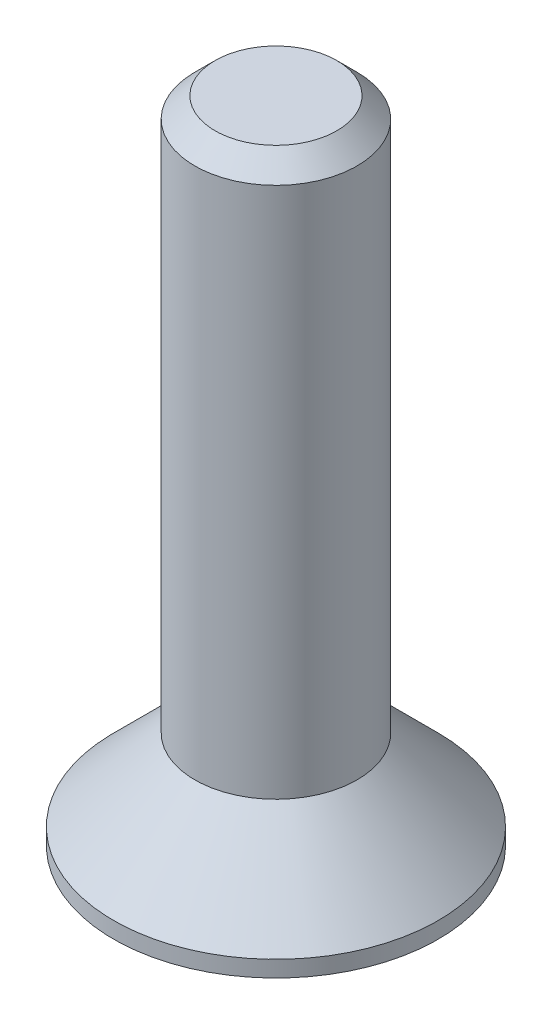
ISO-10303-21;
HEADER;
FILE_DESCRIPTION(('STEP AP214'),'2;1');
FILE_NAME('part.step','',(''),(''),'','','');
FILE_SCHEMA(('AUTOMOTIVE_DESIGN { 1 0 10303 214 1 1 1 1 }'));
ENDSEC;
DATA;
#1=APPLICATION_CONTEXT('core data for automotive mechanical design processes');
#2=APPLICATION_PROTOCOL_DEFINITION('international standard','automotive_design',2000,#1);
#3=PRODUCT_CONTEXT('',#1,'mechanical');
#4=PRODUCT('Part','Part','',(#3));
#5=PRODUCT_RELATED_PRODUCT_CATEGORY('part','',(#4));
#6=PRODUCT_DEFINITION_FORMATION('','',#4);
#7=PRODUCT_DEFINITION_CONTEXT('part definition',#1,'design');
#8=PRODUCT_DEFINITION('design','',#6,#7);
#9=PRODUCT_DEFINITION_SHAPE('','',#8);
#10=(LENGTH_UNIT() NAMED_UNIT(*) SI_UNIT(.MILLI.,.METRE.));
#11=(NAMED_UNIT(*) PLANE_ANGLE_UNIT() SI_UNIT($,.RADIAN.));
#12=(NAMED_UNIT(*) SI_UNIT($,.STERADIAN.) SOLID_ANGLE_UNIT());
#13=UNCERTAINTY_MEASURE_WITH_UNIT(LENGTH_MEASURE(1.E-05),#10,'distance_accuracy_value','');
#14=(GEOMETRIC_REPRESENTATION_CONTEXT(3) GLOBAL_UNCERTAINTY_ASSIGNED_CONTEXT((#13)) GLOBAL_UNIT_ASSIGNED_CONTEXT((#10,
#11,#12)) REPRESENTATION_CONTEXT('',''));
#15=CARTESIAN_POINT('',(0.,0.,0.));
#16=DIRECTION('',(0.,0.,1.));
#17=DIRECTION('',(1.,0.,0.));
#18=AXIS2_PLACEMENT_3D('',#15,#16,#17);
#19=CARTESIAN_POINT('',(-2.,16.,0.));
#20=DIRECTION('',(0.,-1.,0.));
#21=DIRECTION('',(0.,0.,-1.));
#22=AXIS2_PLACEMENT_3D('',#19,#20,#21);
#23=PLANE('',#22);
#24=CARTESIAN_POINT('',(0.,16.,0.));
#25=DIRECTION('',(0.,-1.,0.));
#26=DIRECTION('',(0.,0.,-1.));
#27=AXIS2_PLACEMENT_3D('',#24,#25,#26);
#28=CIRCLE('',#27,1.5);
#29=CARTESIAN_POINT('',(0.,16.,-1.5));
#30=VERTEX_POINT('',#29);
#31=EDGE_CURVE('E11',#30,#30,#28,.F.);
#32=ORIENTED_EDGE('',*,*,#31,.T.);
#33=EDGE_LOOP('',(#32));
#34=FACE_BOUND('',#33,.T.);
#35=ADVANCED_FACE('F32',(#34),#23,.F.);
#36=CARTESIAN_POINT('',(0.,0.,0.));
#37=DIRECTION('',(0.,-1.,0.));
#38=DIRECTION('',(0.,0.,-1.));
#39=AXIS2_PLACEMENT_3D('',#36,#37,#38);
#40=CYLINDRICAL_SURFACE('',#39,2.);
#41=CARTESIAN_POINT('',(0.,15.5,0.));
#42=DIRECTION('',(0.,-1.,0.));
#43=DIRECTION('',(0.,0.,-1.));
#44=AXIS2_PLACEMENT_3D('',#41,#42,#43);
#45=CIRCLE('',#44,2.);
#46=CARTESIAN_POINT('',(0.,15.5,-2.));
#47=VERTEX_POINT('',#46);
#48=EDGE_CURVE('E39',#47,#47,#45,.T.);
#49=ORIENTED_EDGE('',*,*,#48,.T.);
#50=EDGE_LOOP('',(#49));
#51=FACE_BOUND('',#50,.T.);
#52=CARTESIAN_POINT('',(0.,2.4,0.));
#53=DIRECTION('',(0.,-1.,0.));
#54=DIRECTION('',(0.,0.,-1.));
#55=AXIS2_PLACEMENT_3D('',#52,#53,#54);
#56=CIRCLE('',#55,2.);
#57=CARTESIAN_POINT('',(0.,2.4,-2.));
#58=VERTEX_POINT('',#57);
#59=EDGE_CURVE('E146',#58,#58,#56,.T.);
#60=ORIENTED_EDGE('',*,*,#59,.F.);
#61=EDGE_LOOP('',(#60));
#62=FACE_BOUND('',#61,.T.);
#63=ADVANCED_FACE('F151',(#51,#62),#40,.T.);
#64=CARTESIAN_POINT('',(0.,2.4,0.));
#65=DIRECTION('',(0.,-1.,0.));
#66=DIRECTION('',(0.,0.,-1.));
#67=AXIS2_PLACEMENT_3D('',#64,#65,#66);
#68=CONICAL_SURFACE('',#67,2.,0.785398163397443);
#69=CARTESIAN_POINT('',(0.,0.399999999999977,0.));
#70=DIRECTION('',(0.,-1.,0.));
#71=DIRECTION('',(0.,0.,-1.));
#72=AXIS2_PLACEMENT_3D('',#69,#70,#71);
#73=CIRCLE('',#72,4.);
#74=CARTESIAN_POINT('',(0.,0.399999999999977,-4.));
#75=VERTEX_POINT('',#74);
#76=EDGE_CURVE('E143',#75,#75,#73,.T.);
#77=ORIENTED_EDGE('',*,*,#76,.F.);
#78=EDGE_LOOP('',(#77));
#79=FACE_BOUND('',#78,.T.);
#80=ORIENTED_EDGE('',*,*,#59,.T.);
#81=EDGE_LOOP('',(#80));
#82=FACE_BOUND('',#81,.T.);
#83=ADVANCED_FACE('F173',(#79,#82),#68,.T.);
#84=CARTESIAN_POINT('',(0.,0.,0.));
#85=DIRECTION('',(0.,-1.,0.));
#86=DIRECTION('',(0.,0.,-1.));
#87=AXIS2_PLACEMENT_3D('',#84,#85,#86);
#88=CYLINDRICAL_SURFACE('',#87,4.);
#89=CARTESIAN_POINT('',(0.,0.,0.));
#90=DIRECTION('',(0.,-1.,0.));
#91=DIRECTION('',(0.,0.,-1.));
#92=AXIS2_PLACEMENT_3D('',#89,#90,#91);
#93=CIRCLE('',#92,4.);
#94=CARTESIAN_POINT('',(0.,0.,-4.));
#95=VERTEX_POINT('',#94);
#96=EDGE_CURVE('E134',#95,#95,#93,.T.);
#97=ORIENTED_EDGE('',*,*,#96,.F.);
#98=EDGE_LOOP('',(#97));
#99=FACE_BOUND('',#98,.T.);
#100=ORIENTED_EDGE('',*,*,#76,.T.);
#101=EDGE_LOOP('',(#100));
#102=FACE_BOUND('',#101,.T.);
#103=ADVANCED_FACE('F165',(#99,#102),#88,.T.);
#104=CARTESIAN_POINT('',(0.,0.,0.));
#105=DIRECTION('',(0.,1.,0.));
#106=DIRECTION('',(0.,0.,1.));
#107=AXIS2_PLACEMENT_3D('',#104,#105,#106);
#108=PLANE('',#107);
#109=DIRECTION('',(-0.866025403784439,0.,0.5));
#110=VECTOR('',#109,1.);
#111=CARTESIAN_POINT('',(1.25,0.,0.721687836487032));
#112=LINE('',#111,#110);
#113=CARTESIAN_POINT('',(1.25,0.,0.721687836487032));
#114=VERTEX_POINT('',#113);
#115=CARTESIAN_POINT('',(0.,0.,1.44337567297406));
#116=VERTEX_POINT('',#115);
#117=EDGE_CURVE('E100',#114,#116,#112,.T.);
#118=ORIENTED_EDGE('',*,*,#117,.F.);
#119=DIRECTION('',(0.,0.,1.));
#120=VECTOR('',#119,1.);
#121=CARTESIAN_POINT('',(1.25,0.,-0.721687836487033));
#122=LINE('',#121,#120);
#123=CARTESIAN_POINT('',(1.25,0.,-0.721687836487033));
#124=VERTEX_POINT('',#123);
#125=EDGE_CURVE('E46',#124,#114,#122,.T.);
#126=ORIENTED_EDGE('',*,*,#125,.F.);
#127=DIRECTION('',(0.866025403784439,0.,0.5));
#128=VECTOR('',#127,1.);
#129=CARTESIAN_POINT('',(0.,0.,-1.44337567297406));
#130=LINE('',#129,#128);
#131=CARTESIAN_POINT('',(0.,0.,-1.44337567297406));
#132=VERTEX_POINT('',#131);
#133=EDGE_CURVE('E116',#132,#124,#130,.T.);
#134=ORIENTED_EDGE('',*,*,#133,.F.);
#135=DIRECTION('',(0.866025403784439,0.,-0.5));
#136=VECTOR('',#135,1.);
#137=CARTESIAN_POINT('',(-1.25,0.,-0.721687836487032));
#138=LINE('',#137,#136);
#139=CARTESIAN_POINT('',(-1.25,0.,-0.721687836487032));
#140=VERTEX_POINT('',#139);
#141=EDGE_CURVE('E110',#140,#132,#138,.T.);
#142=ORIENTED_EDGE('',*,*,#141,.F.);
#143=DIRECTION('',(0.,0.,-1.));
#144=VECTOR('',#143,1.);
#145=CARTESIAN_POINT('',(-1.25,0.,0.721687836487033));
#146=LINE('',#145,#144);
#147=CARTESIAN_POINT('',(-1.25,0.,0.721687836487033));
#148=VERTEX_POINT('',#147);
#149=EDGE_CURVE('E108',#148,#140,#146,.T.);
#150=ORIENTED_EDGE('',*,*,#149,.F.);
#151=DIRECTION('',(-0.866025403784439,0.,-0.5));
#152=VECTOR('',#151,1.);
#153=CARTESIAN_POINT('',(0.,0.,1.44337567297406));
#154=LINE('',#153,#152);
#155=EDGE_CURVE('E89',#116,#148,#154,.T.);
#156=ORIENTED_EDGE('',*,*,#155,.F.);
#157=EDGE_LOOP('',(#118,#126,#134,#142,#150,#156));
#158=FACE_BOUND('',#157,.T.);
#159=ORIENTED_EDGE('',*,*,#96,.T.);
#160=EDGE_LOOP('',(#159));
#161=FACE_BOUND('',#160,.T.);
#162=ADVANCED_FACE('F104',(#158,#161),#108,.F.);
#163=CARTESIAN_POINT('',(0.,15.5,0.));
#164=DIRECTION('',(0.,-1.,0.));
#165=DIRECTION('',(0.,0.,-1.));
#166=AXIS2_PLACEMENT_3D('',#163,#164,#165);
#167=CONICAL_SURFACE('',#166,2.,0.785398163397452);
#168=ORIENTED_EDGE('',*,*,#31,.F.);
#169=EDGE_LOOP('',(#168));
#170=FACE_BOUND('',#169,.T.);
#171=ORIENTED_EDGE('',*,*,#48,.F.);
#172=EDGE_LOOP('',(#171));
#173=FACE_BOUND('',#172,.T.);
#174=ADVANCED_FACE('F154',(#170,#173),#167,.T.);
#175=CARTESIAN_POINT('',(1.25,2.,-0.721687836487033));
#176=DIRECTION('',(1.,0.,0.));
#177=DIRECTION('',(0.,0.,-1.));
#178=AXIS2_PLACEMENT_3D('',#175,#176,#177);
#179=PLANE('',#178);
#180=ORIENTED_EDGE('',*,*,#125,.T.);
#181=DIRECTION('',(0.,-1.,0.));
#182=VECTOR('',#181,1.);
#183=CARTESIAN_POINT('',(1.25,2.,0.721687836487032));
#184=LINE('',#183,#182);
#185=CARTESIAN_POINT('',(1.25,2.,0.721687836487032));
#186=VERTEX_POINT('',#185);
#187=EDGE_CURVE('E97',#186,#114,#184,.T.);
#188=ORIENTED_EDGE('',*,*,#187,.F.);
#189=DIRECTION('',(0.,0.,1.));
#190=VECTOR('',#189,1.);
#191=CARTESIAN_POINT('',(1.25,2.,-0.721687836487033));
#192=LINE('',#191,#190);
#193=CARTESIAN_POINT('',(1.25,2.,-0.721687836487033));
#194=VERTEX_POINT('',#193);
#195=EDGE_CURVE('E118',#194,#186,#192,.T.);
#196=ORIENTED_EDGE('',*,*,#195,.F.);
#197=DIRECTION('',(0.,-1.,0.));
#198=VECTOR('',#197,1.);
#199=CARTESIAN_POINT('',(1.25,2.,-0.721687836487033));
#200=LINE('',#199,#198);
#201=EDGE_CURVE('E53',#194,#124,#200,.T.);
#202=ORIENTED_EDGE('',*,*,#201,.T.);
#203=EDGE_LOOP('',(#180,#188,#196,#202));
#204=FACE_BOUND('',#203,.T.);
#205=ADVANCED_FACE('F156',(#204),#179,.F.);
#206=CARTESIAN_POINT('',(0.,2.,-1.44337567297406));
#207=DIRECTION('',(0.5,0.,-0.866025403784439));
#208=DIRECTION('',(-0.866025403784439,0.,-0.5));
#209=AXIS2_PLACEMENT_3D('',#206,#207,#208);
#210=PLANE('',#209);
#211=ORIENTED_EDGE('',*,*,#133,.T.);
#212=ORIENTED_EDGE('',*,*,#201,.F.);
#213=DIRECTION('',(0.866025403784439,0.,0.5));
#214=VECTOR('',#213,1.);
#215=CARTESIAN_POINT('',(0.,2.,-1.44337567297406));
#216=LINE('',#215,#214);
#217=CARTESIAN_POINT('',(0.,2.,-1.44337567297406));
#218=VERTEX_POINT('',#217);
#219=EDGE_CURVE('E130',#218,#194,#216,.T.);
#220=ORIENTED_EDGE('',*,*,#219,.F.);
#221=DIRECTION('',(0.,-1.,0.));
#222=VECTOR('',#221,1.);
#223=CARTESIAN_POINT('',(0.,2.,-1.44337567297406));
#224=LINE('',#223,#222);
#225=EDGE_CURVE('E135',#218,#132,#224,.T.);
#226=ORIENTED_EDGE('',*,*,#225,.T.);
#227=EDGE_LOOP('',(#211,#212,#220,#226));
#228=FACE_BOUND('',#227,.T.);
#229=ADVANCED_FACE('F163',(#228),#210,.F.);
#230=CARTESIAN_POINT('',(-1.25,2.,-0.721687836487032));
#231=DIRECTION('',(-0.5,0.,-0.866025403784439));
#232=DIRECTION('',(-0.866025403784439,0.,0.5));
#233=AXIS2_PLACEMENT_3D('',#230,#231,#232);
#234=PLANE('',#233);
#235=ORIENTED_EDGE('',*,*,#141,.T.);
#236=ORIENTED_EDGE('',*,*,#225,.F.);
#237=DIRECTION('',(0.866025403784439,0.,-0.5));
#238=VECTOR('',#237,1.);
#239=CARTESIAN_POINT('',(-1.25,2.,-0.721687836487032));
#240=LINE('',#239,#238);
#241=CARTESIAN_POINT('',(-1.25,2.,-0.721687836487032));
#242=VERTEX_POINT('',#241);
#243=EDGE_CURVE('E127',#242,#218,#240,.T.);
#244=ORIENTED_EDGE('',*,*,#243,.F.);
#245=DIRECTION('',(0.,-1.,0.));
#246=VECTOR('',#245,1.);
#247=CARTESIAN_POINT('',(-1.25,2.,-0.721687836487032));
#248=LINE('',#247,#246);
#249=EDGE_CURVE('E137',#242,#140,#248,.T.);
#250=ORIENTED_EDGE('',*,*,#249,.T.);
#251=EDGE_LOOP('',(#235,#236,#244,#250));
#252=FACE_BOUND('',#251,.T.);
#253=ADVANCED_FACE('F212',(#252),#234,.F.);
#254=CARTESIAN_POINT('',(-1.25,2.,0.721687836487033));
#255=DIRECTION('',(-1.,0.,0.));
#256=DIRECTION('',(0.,0.,1.));
#257=AXIS2_PLACEMENT_3D('',#254,#255,#256);
#258=PLANE('',#257);
#259=ORIENTED_EDGE('',*,*,#149,.T.);
#260=ORIENTED_EDGE('',*,*,#249,.F.);
#261=DIRECTION('',(0.,0.,-1.));
#262=VECTOR('',#261,1.);
#263=CARTESIAN_POINT('',(-1.25,2.,0.721687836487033));
#264=LINE('',#263,#262);
#265=CARTESIAN_POINT('',(-1.25,2.,0.721687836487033));
#266=VERTEX_POINT('',#265);
#267=EDGE_CURVE('E124',#266,#242,#264,.T.);
#268=ORIENTED_EDGE('',*,*,#267,.F.);
#269=DIRECTION('',(0.,-1.,0.));
#270=VECTOR('',#269,1.);
#271=CARTESIAN_POINT('',(-1.25,2.,0.721687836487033));
#272=LINE('',#271,#270);
#273=EDGE_CURVE('E96',#266,#148,#272,.T.);
#274=ORIENTED_EDGE('',*,*,#273,.T.);
#275=EDGE_LOOP('',(#259,#260,#268,#274));
#276=FACE_BOUND('',#275,.T.);
#277=ADVANCED_FACE('F221',(#276),#258,.F.);
#278=CARTESIAN_POINT('',(0.,2.,1.44337567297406));
#279=DIRECTION('',(-0.5,0.,0.866025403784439));
#280=DIRECTION('',(0.866025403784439,0.,0.5));
#281=AXIS2_PLACEMENT_3D('',#278,#279,#280);
#282=PLANE('',#281);
#283=ORIENTED_EDGE('',*,*,#155,.T.);
#284=ORIENTED_EDGE('',*,*,#273,.F.);
#285=DIRECTION('',(-0.866025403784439,0.,-0.5));
#286=VECTOR('',#285,1.);
#287=CARTESIAN_POINT('',(0.,2.,1.44337567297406));
#288=LINE('',#287,#286);
#289=CARTESIAN_POINT('',(0.,2.,1.44337567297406));
#290=VERTEX_POINT('',#289);
#291=EDGE_CURVE('E92',#290,#266,#288,.T.);
#292=ORIENTED_EDGE('',*,*,#291,.F.);
#293=DIRECTION('',(0.,-1.,0.));
#294=VECTOR('',#293,1.);
#295=CARTESIAN_POINT('',(0.,2.,1.44337567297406));
#296=LINE('',#295,#294);
#297=EDGE_CURVE('E85',#290,#116,#296,.T.);
#298=ORIENTED_EDGE('',*,*,#297,.T.);
#299=EDGE_LOOP('',(#283,#284,#292,#298));
#300=FACE_BOUND('',#299,.T.);
#301=ADVANCED_FACE('F87',(#300),#282,.F.);
#302=CARTESIAN_POINT('',(1.25,2.,0.721687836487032));
#303=DIRECTION('',(0.5,0.,0.866025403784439));
#304=DIRECTION('',(0.866025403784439,0.,-0.5));
#305=AXIS2_PLACEMENT_3D('',#302,#303,#304);
#306=PLANE('',#305);
#307=ORIENTED_EDGE('',*,*,#117,.T.);
#308=ORIENTED_EDGE('',*,*,#297,.F.);
#309=DIRECTION('',(-0.866025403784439,0.,0.5));
#310=VECTOR('',#309,1.);
#311=CARTESIAN_POINT('',(1.25,2.,0.721687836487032));
#312=LINE('',#311,#310);
#313=EDGE_CURVE('E121',#186,#290,#312,.T.);
#314=ORIENTED_EDGE('',*,*,#313,.F.);
#315=ORIENTED_EDGE('',*,*,#187,.T.);
#316=EDGE_LOOP('',(#307,#308,#314,#315));
#317=FACE_BOUND('',#316,.T.);
#318=ADVANCED_FACE('F101',(#317),#306,.F.);
#319=CARTESIAN_POINT('',(1.25,2.,2.1650635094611));
#320=DIRECTION('',(0.,-1.,0.));
#321=DIRECTION('',(0.,0.,-1.));
#322=AXIS2_PLACEMENT_3D('',#319,#320,#321);
#323=PLANE('',#322);
#324=ORIENTED_EDGE('',*,*,#195,.T.);
#325=ORIENTED_EDGE('',*,*,#313,.T.);
#326=ORIENTED_EDGE('',*,*,#291,.T.);
#327=ORIENTED_EDGE('',*,*,#267,.T.);
#328=ORIENTED_EDGE('',*,*,#243,.T.);
#329=ORIENTED_EDGE('',*,*,#219,.T.);
#330=EDGE_LOOP('',(#324,#325,#326,#327,#328,#329));
#331=FACE_BOUND('',#330,.T.);
#332=ADVANCED_FACE('F248',(#331),#323,.T.);
#333=CLOSED_SHELL('',(#35,#63,#83,#103,#162,#174,#205,#229,#253,#277,#301,#318,#332));
#334=MANIFOLD_SOLID_BREP('B2',#333);
#335=ADVANCED_BREP_SHAPE_REPRESENTATION('',(#18,#334),#14);
#336=SHAPE_DEFINITION_REPRESENTATION(#9,#335);
ENDSEC;
END-ISO-10303-21;
